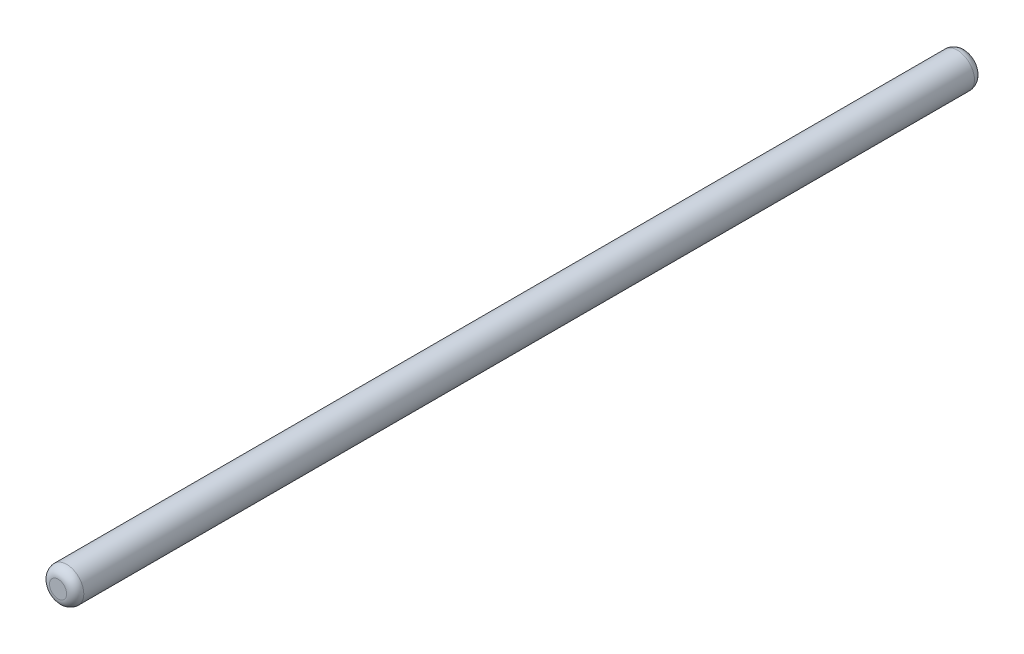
from build123d import *

# Parameters (mm, degrees)
ESQUISSE1_R          = 2
BASE_EXTRUSION_DEPTH = 106
CONG_2_R             = 1


with BuildPart() as part:
    # Esquisse1 → Base-Extrusion (new body)
    with BuildSketch(Plane.XY):
        Circle(ESQUISSE1_R)
    extrude(amount=BASE_EXTRUSION_DEPTH)

    # Cong_2
    cong_2_edges = [part.edges().sort_by_distance(p)[0] for p in [
        (-2, 0, 0),
        (-2, 0, 106),
    ]]
    fillet(cong_2_edges, radius=CONG_2_R)


solid = part.part
